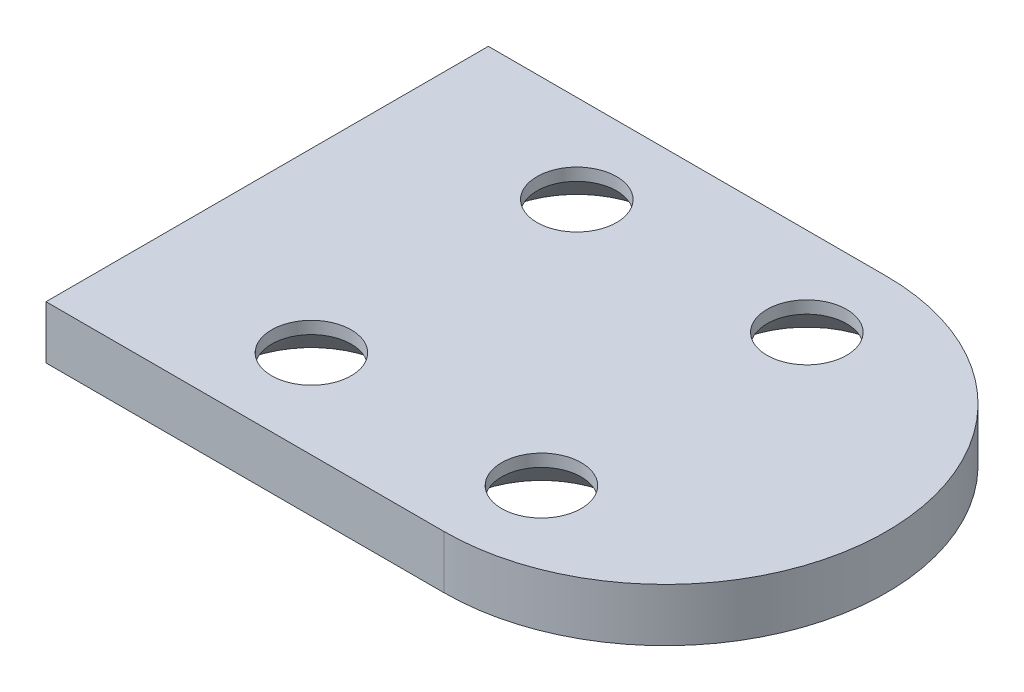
ISO-10303-21;
HEADER;
FILE_DESCRIPTION(('STEP AP214'),'2;1');
FILE_NAME('part.step','',(''),(''),'','','');
FILE_SCHEMA(('AUTOMOTIVE_DESIGN { 1 0 10303 214 1 1 1 1 }'));
ENDSEC;
DATA;
#1=APPLICATION_CONTEXT('core data for automotive mechanical design processes');
#2=APPLICATION_PROTOCOL_DEFINITION('international standard','automotive_design',2000,#1);
#3=PRODUCT_CONTEXT('',#1,'mechanical');
#4=PRODUCT('Part','Part','',(#3));
#5=PRODUCT_RELATED_PRODUCT_CATEGORY('part','',(#4));
#6=PRODUCT_DEFINITION_FORMATION('','',#4);
#7=PRODUCT_DEFINITION_CONTEXT('part definition',#1,'design');
#8=PRODUCT_DEFINITION('design','',#6,#7);
#9=PRODUCT_DEFINITION_SHAPE('','',#8);
#10=(LENGTH_UNIT() NAMED_UNIT(*) SI_UNIT(.MILLI.,.METRE.));
#11=(NAMED_UNIT(*) PLANE_ANGLE_UNIT() SI_UNIT($,.RADIAN.));
#12=(NAMED_UNIT(*) SI_UNIT($,.STERADIAN.) SOLID_ANGLE_UNIT());
#13=UNCERTAINTY_MEASURE_WITH_UNIT(LENGTH_MEASURE(1.E-05),#10,'distance_accuracy_value','');
#14=(GEOMETRIC_REPRESENTATION_CONTEXT(3) GLOBAL_UNCERTAINTY_ASSIGNED_CONTEXT((#13)) GLOBAL_UNIT_ASSIGNED_CONTEXT((#10,
#11,#12)) REPRESENTATION_CONTEXT('',''));
#15=CARTESIAN_POINT('',(0.,0.,0.));
#16=DIRECTION('',(0.,0.,1.));
#17=DIRECTION('',(1.,0.,0.));
#18=AXIS2_PLACEMENT_3D('',#15,#16,#17);
#19=CARTESIAN_POINT('',(0.,-2.99999999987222,15.));
#20=DIRECTION('',(0.,-1.,0.));
#21=DIRECTION('',(1.,0.,0.));
#22=AXIS2_PLACEMENT_3D('',#19,#20,#21);
#23=CONICAL_SURFACE('',#22,4.59999999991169,0.796150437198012);
#24=CARTESIAN_POINT('',(0.,-2.9999999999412,15.));
#25=DIRECTION('',(0.,-1.,0.));
#26=DIRECTION('',(1.,0.,0.));
#27=AXIS2_PLACEMENT_3D('',#24,#25,#26);
#28=CIRCLE('',#27,4.59999999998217);
#29=CARTESIAN_POINT('',(4.59999999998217,-2.9999999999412,15.));
#30=VERTEX_POINT('',#29);
#31=EDGE_CURVE('E19',#30,#30,#28,.F.);
#32=ORIENTED_EDGE('',*,*,#31,.F.);
#33=EDGE_LOOP('',(#32));
#34=FACE_BOUND('',#33,.T.);
#35=CARTESIAN_POINT('',(0.,-0.7,15.));
#36=DIRECTION('',(0.,1.,0.));
#37=DIRECTION('',(0.,0.,1.));
#38=AXIS2_PLACEMENT_3D('',#35,#36,#37);
#39=CIRCLE('',#38,2.25);
#40=CARTESIAN_POINT('',(0.,-0.7,17.25));
#41=VERTEX_POINT('',#40);
#42=EDGE_CURVE('E121',#41,#41,#39,.T.);
#43=ORIENTED_EDGE('',*,*,#42,.T.);
#44=EDGE_LOOP('',(#43));
#45=FACE_BOUND('',#44,.T.);
#46=ADVANCED_FACE('F16',(#34,#45),#23,.F.);
#47=CARTESIAN_POINT('',(13.,-2.99999999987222,15.));
#48=DIRECTION('',(0.,-1.,0.));
#49=DIRECTION('',(1.,0.,0.));
#50=AXIS2_PLACEMENT_3D('',#47,#48,#49);
#51=CONICAL_SURFACE('',#50,4.59999999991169,0.796150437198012);
#52=CARTESIAN_POINT('',(13.,-2.9999999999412,15.));
#53=DIRECTION('',(0.,-1.,0.));
#54=DIRECTION('',(1.,0.,0.));
#55=AXIS2_PLACEMENT_3D('',#52,#53,#54);
#56=CIRCLE('',#55,4.59999999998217);
#57=CARTESIAN_POINT('',(17.5999999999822,-2.9999999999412,15.));
#58=VERTEX_POINT('',#57);
#59=EDGE_CURVE('E137',#58,#58,#56,.F.);
#60=ORIENTED_EDGE('',*,*,#59,.F.);
#61=EDGE_LOOP('',(#60));
#62=FACE_BOUND('',#61,.T.);
#63=CARTESIAN_POINT('',(13.,-0.7,15.));
#64=DIRECTION('',(0.,1.,0.));
#65=DIRECTION('',(0.,0.,1.));
#66=AXIS2_PLACEMENT_3D('',#63,#64,#65);
#67=CIRCLE('',#66,2.25);
#68=CARTESIAN_POINT('',(13.,-0.7,17.25));
#69=VERTEX_POINT('',#68);
#70=EDGE_CURVE('E118',#69,#69,#67,.T.);
#71=ORIENTED_EDGE('',*,*,#70,.T.);
#72=EDGE_LOOP('',(#71));
#73=FACE_BOUND('',#72,.T.);
#74=ADVANCED_FACE('F148',(#62,#73),#51,.F.);
#75=CARTESIAN_POINT('',(0.,-2.99999999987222,0.));
#76=DIRECTION('',(0.,-1.,0.));
#77=DIRECTION('',(1.,0.,0.));
#78=AXIS2_PLACEMENT_3D('',#75,#76,#77);
#79=CONICAL_SURFACE('',#78,4.59999999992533,0.796150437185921);
#80=CARTESIAN_POINT('',(0.,-2.99999999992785,0.));
#81=DIRECTION('',(0.,-1.,0.));
#82=DIRECTION('',(1.,0.,0.));
#83=AXIS2_PLACEMENT_3D('',#80,#81,#82);
#84=CIRCLE('',#83,4.59999999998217);
#85=CARTESIAN_POINT('',(4.59999999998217,-2.99999999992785,0.));
#86=VERTEX_POINT('',#85);
#87=EDGE_CURVE('E135',#86,#86,#84,.F.);
#88=ORIENTED_EDGE('',*,*,#87,.F.);
#89=EDGE_LOOP('',(#88));
#90=FACE_BOUND('',#89,.T.);
#91=CARTESIAN_POINT('',(0.,-0.7,0.));
#92=DIRECTION('',(0.,1.,0.));
#93=DIRECTION('',(0.,0.,1.));
#94=AXIS2_PLACEMENT_3D('',#91,#92,#93);
#95=CIRCLE('',#94,2.25);
#96=CARTESIAN_POINT('',(0.,-0.7,2.25));
#97=VERTEX_POINT('',#96);
#98=EDGE_CURVE('E115',#97,#97,#95,.T.);
#99=ORIENTED_EDGE('',*,*,#98,.T.);
#100=EDGE_LOOP('',(#99));
#101=FACE_BOUND('',#100,.T.);
#102=ADVANCED_FACE('F191',(#90,#101),#79,.F.);
#103=CARTESIAN_POINT('',(13.,-2.99999999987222,0.));
#104=DIRECTION('',(0.,-1.,0.));
#105=DIRECTION('',(1.,0.,0.));
#106=AXIS2_PLACEMENT_3D('',#103,#104,#105);
#107=CONICAL_SURFACE('',#106,4.59999999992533,0.796150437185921);
#108=CARTESIAN_POINT('',(13.,-2.99999999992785,0.));
#109=DIRECTION('',(0.,-1.,0.));
#110=DIRECTION('',(1.,0.,0.));
#111=AXIS2_PLACEMENT_3D('',#108,#109,#110);
#112=CIRCLE('',#111,4.59999999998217);
#113=CARTESIAN_POINT('',(17.5999999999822,-2.99999999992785,0.));
#114=VERTEX_POINT('',#113);
#115=EDGE_CURVE('E123',#114,#114,#112,.F.);
#116=ORIENTED_EDGE('',*,*,#115,.F.);
#117=EDGE_LOOP('',(#116));
#118=FACE_BOUND('',#117,.T.);
#119=CARTESIAN_POINT('',(13.,-0.7,0.));
#120=DIRECTION('',(0.,1.,0.));
#121=DIRECTION('',(0.,0.,1.));
#122=AXIS2_PLACEMENT_3D('',#119,#120,#121);
#123=CIRCLE('',#122,2.25);
#124=CARTESIAN_POINT('',(13.,-0.7,2.25));
#125=VERTEX_POINT('',#124);
#126=EDGE_CURVE('E104',#125,#125,#123,.T.);
#127=ORIENTED_EDGE('',*,*,#126,.T.);
#128=EDGE_LOOP('',(#127));
#129=FACE_BOUND('',#128,.T.);
#130=ADVANCED_FACE('F187',(#118,#129),#107,.F.);
#131=CARTESIAN_POINT('',(5.51792199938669,-3.,7.5));
#132=DIRECTION('',(0.,-1.,0.));
#133=DIRECTION('',(0.,0.,-1.));
#134=AXIS2_PLACEMENT_3D('',#131,#132,#133);
#135=PLANE('',#134);
#136=DIRECTION('',(1.,0.,0.));
#137=VECTOR('',#136,1.);
#138=CARTESIAN_POINT('',(-10.,-3.,20.));
#139=LINE('',#138,#137);
#140=CARTESIAN_POINT('',(-10.,-3.,20.));
#141=VERTEX_POINT('',#140);
#142=CARTESIAN_POINT('',(12.5,-3.,20.));
#143=VERTEX_POINT('',#142);
#144=EDGE_CURVE('E51',#141,#143,#139,.T.);
#145=ORIENTED_EDGE('',*,*,#144,.F.);
#146=DIRECTION('',(0.,0.,1.));
#147=VECTOR('',#146,1.);
#148=CARTESIAN_POINT('',(-10.,-3.,-5.));
#149=LINE('',#148,#147);
#150=CARTESIAN_POINT('',(-10.,-3.,-5.));
#151=VERTEX_POINT('',#150);
#152=EDGE_CURVE('E68',#151,#141,#149,.T.);
#153=ORIENTED_EDGE('',*,*,#152,.F.);
#154=DIRECTION('',(-1.,0.,0.));
#155=VECTOR('',#154,1.);
#156=CARTESIAN_POINT('',(12.5,-3.,-5.));
#157=LINE('',#156,#155);
#158=CARTESIAN_POINT('',(12.5,-3.,-5.));
#159=VERTEX_POINT('',#158);
#160=EDGE_CURVE('E56',#159,#151,#157,.T.);
#161=ORIENTED_EDGE('',*,*,#160,.F.);
#162=CARTESIAN_POINT('',(12.5,-3.,7.50000000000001));
#163=DIRECTION('',(0.,1.,0.));
#164=DIRECTION('',(0.,0.,1.));
#165=AXIS2_PLACEMENT_3D('',#162,#163,#164);
#166=CIRCLE('',#165,12.5);
#167=EDGE_CURVE('E92',#143,#159,#166,.T.);
#168=ORIENTED_EDGE('',*,*,#167,.F.);
#169=EDGE_LOOP('',(#145,#153,#161,#168));
#170=FACE_BOUND('',#169,.T.);
#171=ORIENTED_EDGE('',*,*,#115,.T.);
#172=EDGE_LOOP('',(#171));
#173=FACE_BOUND('',#172,.T.);
#174=ORIENTED_EDGE('',*,*,#87,.T.);
#175=EDGE_LOOP('',(#174));
#176=FACE_BOUND('',#175,.T.);
#177=ORIENTED_EDGE('',*,*,#59,.T.);
#178=EDGE_LOOP('',(#177));
#179=FACE_BOUND('',#178,.T.);
#180=ORIENTED_EDGE('',*,*,#31,.T.);
#181=EDGE_LOOP('',(#180));
#182=FACE_BOUND('',#181,.T.);
#183=ADVANCED_FACE('F144',(#170,#173,#176,#179,#182),#135,.T.);
#184=CARTESIAN_POINT('',(0.,-0.35,15.));
#185=DIRECTION('',(0.,1.,0.));
#186=DIRECTION('',(0.,0.,1.));
#187=AXIS2_PLACEMENT_3D('',#184,#185,#186);
#188=CYLINDRICAL_SURFACE('',#187,2.25);
#189=ORIENTED_EDGE('',*,*,#42,.F.);
#190=EDGE_LOOP('',(#189));
#191=FACE_BOUND('',#190,.T.);
#192=CARTESIAN_POINT('',(0.,0.,15.));
#193=DIRECTION('',(0.,1.,0.));
#194=DIRECTION('',(0.,0.,1.));
#195=AXIS2_PLACEMENT_3D('',#192,#193,#194);
#196=CIRCLE('',#195,2.25);
#197=CARTESIAN_POINT('',(0.,0.,17.25));
#198=VERTEX_POINT('',#197);
#199=EDGE_CURVE('E94',#198,#198,#196,.T.);
#200=ORIENTED_EDGE('',*,*,#199,.T.);
#201=EDGE_LOOP('',(#200));
#202=FACE_BOUND('',#201,.T.);
#203=ADVANCED_FACE('F151',(#191,#202),#188,.F.);
#204=CARTESIAN_POINT('',(13.,-0.35,15.));
#205=DIRECTION('',(0.,1.,0.));
#206=DIRECTION('',(0.,0.,1.));
#207=AXIS2_PLACEMENT_3D('',#204,#205,#206);
#208=CYLINDRICAL_SURFACE('',#207,2.25);
#209=ORIENTED_EDGE('',*,*,#70,.F.);
#210=EDGE_LOOP('',(#209));
#211=FACE_BOUND('',#210,.T.);
#212=CARTESIAN_POINT('',(13.,0.,15.));
#213=DIRECTION('',(0.,1.,0.));
#214=DIRECTION('',(0.,0.,1.));
#215=AXIS2_PLACEMENT_3D('',#212,#213,#214);
#216=CIRCLE('',#215,2.25);
#217=CARTESIAN_POINT('',(13.,0.,17.25));
#218=VERTEX_POINT('',#217);
#219=EDGE_CURVE('E127',#218,#218,#216,.T.);
#220=ORIENTED_EDGE('',*,*,#219,.T.);
#221=EDGE_LOOP('',(#220));
#222=FACE_BOUND('',#221,.T.);
#223=ADVANCED_FACE('F154',(#211,#222),#208,.F.);
#224=CARTESIAN_POINT('',(0.,-0.35,0.));
#225=DIRECTION('',(0.,1.,0.));
#226=DIRECTION('',(0.,0.,1.));
#227=AXIS2_PLACEMENT_3D('',#224,#225,#226);
#228=CYLINDRICAL_SURFACE('',#227,2.25);
#229=ORIENTED_EDGE('',*,*,#98,.F.);
#230=EDGE_LOOP('',(#229));
#231=FACE_BOUND('',#230,.T.);
#232=CARTESIAN_POINT('',(0.,0.,0.));
#233=DIRECTION('',(0.,1.,0.));
#234=DIRECTION('',(0.,0.,1.));
#235=AXIS2_PLACEMENT_3D('',#232,#233,#234);
#236=CIRCLE('',#235,2.25);
#237=CARTESIAN_POINT('',(0.,0.,2.25));
#238=VERTEX_POINT('',#237);
#239=EDGE_CURVE('E83',#238,#238,#236,.T.);
#240=ORIENTED_EDGE('',*,*,#239,.T.);
#241=EDGE_LOOP('',(#240));
#242=FACE_BOUND('',#241,.T.);
#243=ADVANCED_FACE('F177',(#231,#242),#228,.F.);
#244=CARTESIAN_POINT('',(13.,-0.35,0.));
#245=DIRECTION('',(0.,1.,0.));
#246=DIRECTION('',(0.,0.,1.));
#247=AXIS2_PLACEMENT_3D('',#244,#245,#246);
#248=CYLINDRICAL_SURFACE('',#247,2.25);
#249=ORIENTED_EDGE('',*,*,#126,.F.);
#250=EDGE_LOOP('',(#249));
#251=FACE_BOUND('',#250,.T.);
#252=CARTESIAN_POINT('',(13.,0.,0.));
#253=DIRECTION('',(0.,1.,0.));
#254=DIRECTION('',(0.,0.,1.));
#255=AXIS2_PLACEMENT_3D('',#252,#253,#254);
#256=CIRCLE('',#255,2.25);
#257=CARTESIAN_POINT('',(13.,0.,2.25));
#258=VERTEX_POINT('',#257);
#259=EDGE_CURVE('E80',#258,#258,#256,.T.);
#260=ORIENTED_EDGE('',*,*,#259,.T.);
#261=EDGE_LOOP('',(#260));
#262=FACE_BOUND('',#261,.T.);
#263=ADVANCED_FACE('F174',(#251,#262),#248,.F.);
#264=CARTESIAN_POINT('',(-10.,0.,20.));
#265=DIRECTION('',(0.,0.,1.));
#266=DIRECTION('',(1.,0.,0.));
#267=AXIS2_PLACEMENT_3D('',#264,#265,#266);
#268=PLANE('',#267);
#269=DIRECTION('',(1.,0.,0.));
#270=VECTOR('',#269,1.);
#271=CARTESIAN_POINT('',(5.51792199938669,0.,20.));
#272=LINE('',#271,#270);
#273=CARTESIAN_POINT('',(12.5,0.,20.));
#274=VERTEX_POINT('',#273);
#275=CARTESIAN_POINT('',(-10.,0.,20.));
#276=VERTEX_POINT('',#275);
#277=EDGE_CURVE('E75',#274,#276,#272,.F.);
#278=ORIENTED_EDGE('',*,*,#277,.T.);
#279=DIRECTION('',(0.,1.,0.));
#280=VECTOR('',#279,1.);
#281=CARTESIAN_POINT('',(-10.,0.,20.));
#282=LINE('',#281,#280);
#283=EDGE_CURVE('E63',#141,#276,#282,.T.);
#284=ORIENTED_EDGE('',*,*,#283,.F.);
#285=ORIENTED_EDGE('',*,*,#144,.T.);
#286=DIRECTION('',(0.,1.,0.));
#287=VECTOR('',#286,1.);
#288=CARTESIAN_POINT('',(12.5,0.,20.));
#289=LINE('',#288,#287);
#290=EDGE_CURVE('E79',#274,#143,#289,.F.);
#291=ORIENTED_EDGE('',*,*,#290,.F.);
#292=EDGE_LOOP('',(#278,#284,#285,#291));
#293=FACE_BOUND('',#292,.T.);
#294=ADVANCED_FACE('F78',(#293),#268,.T.);
#295=CARTESIAN_POINT('',(-10.,0.,-5.));
#296=DIRECTION('',(-1.,0.,0.));
#297=DIRECTION('',(0.,0.,1.));
#298=AXIS2_PLACEMENT_3D('',#295,#296,#297);
#299=PLANE('',#298);
#300=DIRECTION('',(0.,0.,-1.));
#301=VECTOR('',#300,1.);
#302=CARTESIAN_POINT('',(-10.,0.,7.5));
#303=LINE('',#302,#301);
#304=CARTESIAN_POINT('',(-10.,0.,-5.));
#305=VERTEX_POINT('',#304);
#306=EDGE_CURVE('E67',#276,#305,#303,.T.);
#307=ORIENTED_EDGE('',*,*,#306,.T.);
#308=DIRECTION('',(0.,1.,0.));
#309=VECTOR('',#308,1.);
#310=CARTESIAN_POINT('',(-10.,0.,-5.));
#311=LINE('',#310,#309);
#312=EDGE_CURVE('E95',#151,#305,#311,.T.);
#313=ORIENTED_EDGE('',*,*,#312,.F.);
#314=ORIENTED_EDGE('',*,*,#152,.T.);
#315=ORIENTED_EDGE('',*,*,#283,.T.);
#316=EDGE_LOOP('',(#307,#313,#314,#315));
#317=FACE_BOUND('',#316,.T.);
#318=ADVANCED_FACE('F65',(#317),#299,.T.);
#319=CARTESIAN_POINT('',(12.5,0.,-5.));
#320=DIRECTION('',(0.,0.,-1.));
#321=DIRECTION('',(-1.,0.,0.));
#322=AXIS2_PLACEMENT_3D('',#319,#320,#321);
#323=PLANE('',#322);
#324=DIRECTION('',(1.,0.,0.));
#325=VECTOR('',#324,1.);
#326=CARTESIAN_POINT('',(5.51792199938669,0.,-5.));
#327=LINE('',#326,#325);
#328=CARTESIAN_POINT('',(12.5,0.,-5.));
#329=VERTEX_POINT('',#328);
#330=EDGE_CURVE('E25',#305,#329,#327,.T.);
#331=ORIENTED_EDGE('',*,*,#330,.T.);
#332=DIRECTION('',(0.,1.,0.));
#333=VECTOR('',#332,1.);
#334=CARTESIAN_POINT('',(12.5,0.,-4.99999999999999));
#335=LINE('',#334,#333);
#336=EDGE_CURVE('E33',#159,#329,#335,.T.);
#337=ORIENTED_EDGE('',*,*,#336,.F.);
#338=ORIENTED_EDGE('',*,*,#160,.T.);
#339=ORIENTED_EDGE('',*,*,#312,.T.);
#340=EDGE_LOOP('',(#331,#337,#338,#339));
#341=FACE_BOUND('',#340,.T.);
#342=ADVANCED_FACE('F165',(#341),#323,.T.);
#343=CARTESIAN_POINT('',(12.5,0.,7.50000000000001));
#344=DIRECTION('',(0.,1.,0.));
#345=DIRECTION('',(0.,0.,1.));
#346=AXIS2_PLACEMENT_3D('',#343,#344,#345);
#347=CYLINDRICAL_SURFACE('',#346,12.5);
#348=CARTESIAN_POINT('',(12.5,0.,7.50000000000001));
#349=DIRECTION('',(0.,1.,0.));
#350=DIRECTION('',(0.,0.,1.));
#351=AXIS2_PLACEMENT_3D('',#348,#349,#350);
#352=CIRCLE('',#351,12.5);
#353=EDGE_CURVE('E11',#329,#274,#352,.F.);
#354=ORIENTED_EDGE('',*,*,#353,.T.);
#355=ORIENTED_EDGE('',*,*,#290,.T.);
#356=ORIENTED_EDGE('',*,*,#167,.T.);
#357=ORIENTED_EDGE('',*,*,#336,.T.);
#358=EDGE_LOOP('',(#354,#355,#356,#357));
#359=FACE_BOUND('',#358,.T.);
#360=ADVANCED_FACE('F159',(#359),#347,.T.);
#361=CARTESIAN_POINT('',(5.51792199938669,0.,7.5));
#362=DIRECTION('',(0.,-1.,0.));
#363=DIRECTION('',(0.,0.,-1.));
#364=AXIS2_PLACEMENT_3D('',#361,#362,#363);
#365=PLANE('',#364);
#366=ORIENTED_EDGE('',*,*,#330,.F.);
#367=ORIENTED_EDGE('',*,*,#306,.F.);
#368=ORIENTED_EDGE('',*,*,#277,.F.);
#369=ORIENTED_EDGE('',*,*,#353,.F.);
#370=EDGE_LOOP('',(#366,#367,#368,#369));
#371=FACE_BOUND('',#370,.T.);
#372=ORIENTED_EDGE('',*,*,#259,.F.);
#373=EDGE_LOOP('',(#372));
#374=FACE_BOUND('',#373,.T.);
#375=ORIENTED_EDGE('',*,*,#239,.F.);
#376=EDGE_LOOP('',(#375));
#377=FACE_BOUND('',#376,.T.);
#378=ORIENTED_EDGE('',*,*,#219,.F.);
#379=EDGE_LOOP('',(#378));
#380=FACE_BOUND('',#379,.T.);
#381=ORIENTED_EDGE('',*,*,#199,.F.);
#382=EDGE_LOOP('',(#381));
#383=FACE_BOUND('',#382,.T.);
#384=ADVANCED_FACE('F73',(#371,#374,#377,#380,#383),#365,.F.);
#385=CLOSED_SHELL('',(#46,#74,#102,#130,#183,#203,#223,#243,#263,#294,#318,#342,#360,#384));
#386=MANIFOLD_SOLID_BREP('B1',#385);
#387=ADVANCED_BREP_SHAPE_REPRESENTATION('',(#18,#386),#14);
#388=SHAPE_DEFINITION_REPRESENTATION(#9,#387);
ENDSEC;
END-ISO-10303-21;
